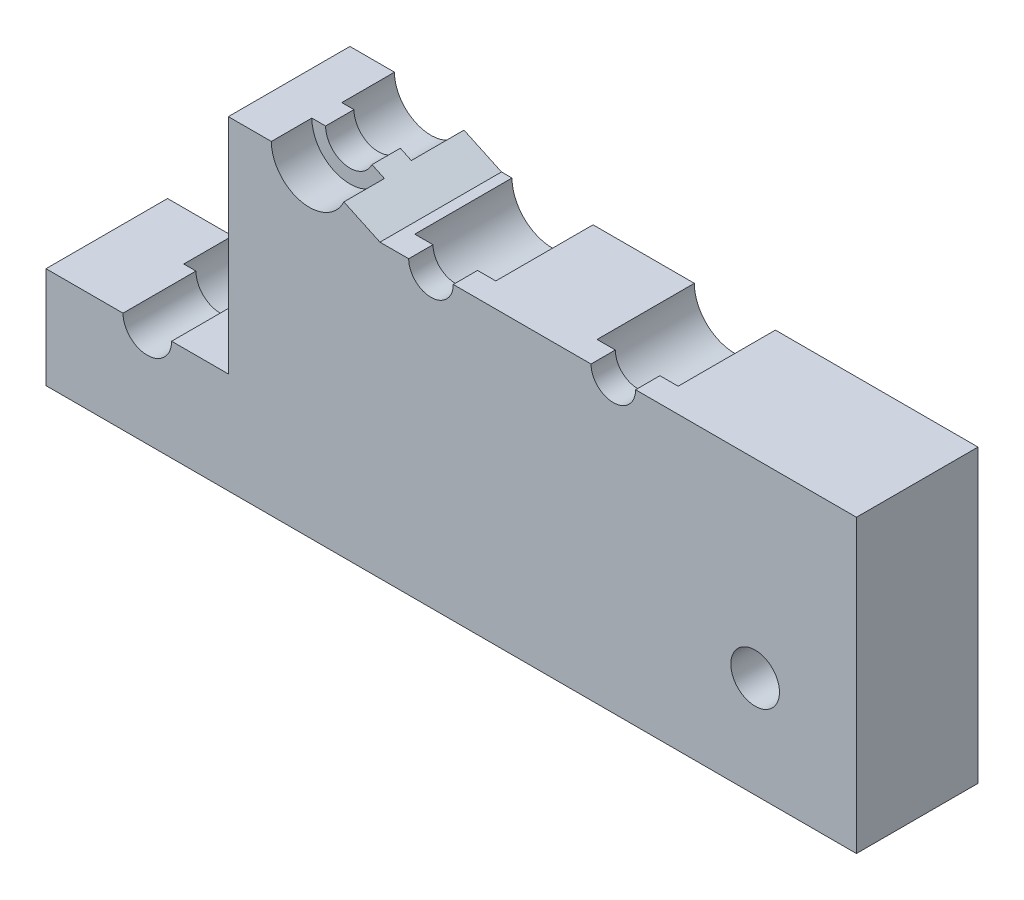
ISO-10303-21;
HEADER;
FILE_DESCRIPTION(('STEP AP214'),'2;1');
FILE_NAME('part.step','',(''),(''),'','','');
FILE_SCHEMA(('AUTOMOTIVE_DESIGN { 1 0 10303 214 1 1 1 1 }'));
ENDSEC;
DATA;
#1=APPLICATION_CONTEXT('core data for automotive mechanical design processes');
#2=APPLICATION_PROTOCOL_DEFINITION('international standard','automotive_design',2000,#1);
#3=PRODUCT_CONTEXT('',#1,'mechanical');
#4=PRODUCT('Part','Part','',(#3));
#5=PRODUCT_RELATED_PRODUCT_CATEGORY('part','',(#4));
#6=PRODUCT_DEFINITION_FORMATION('','',#4);
#7=PRODUCT_DEFINITION_CONTEXT('part definition',#1,'design');
#8=PRODUCT_DEFINITION('design','',#6,#7);
#9=PRODUCT_DEFINITION_SHAPE('','',#8);
#10=(LENGTH_UNIT() NAMED_UNIT(*) SI_UNIT(.MILLI.,.METRE.));
#11=(NAMED_UNIT(*) PLANE_ANGLE_UNIT() SI_UNIT($,.RADIAN.));
#12=(NAMED_UNIT(*) SI_UNIT($,.STERADIAN.) SOLID_ANGLE_UNIT());
#13=UNCERTAINTY_MEASURE_WITH_UNIT(LENGTH_MEASURE(1.E-05),#10,'distance_accuracy_value','');
#14=(GEOMETRIC_REPRESENTATION_CONTEXT(3) GLOBAL_UNCERTAINTY_ASSIGNED_CONTEXT((#13)) GLOBAL_UNIT_ASSIGNED_CONTEXT((#10,
#11,#12)) REPRESENTATION_CONTEXT('',''));
#15=CARTESIAN_POINT('',(0.,0.,0.));
#16=DIRECTION('',(0.,0.,1.));
#17=DIRECTION('',(1.,0.,0.));
#18=AXIS2_PLACEMENT_3D('',#15,#16,#17);
#19=CARTESIAN_POINT('',(0.,0.,30.));
#20=DIRECTION('',(1.,0.,0.));
#21=DIRECTION('',(0.,0.,-1.));
#22=AXIS2_PLACEMENT_3D('',#19,#20,#21);
#23=PLANE('',#22);
#24=DIRECTION('',(0.,-1.,0.));
#25=VECTOR('',#24,1.);
#26=CARTESIAN_POINT('',(0.,0.,30.));
#27=LINE('',#26,#25);
#28=CARTESIAN_POINT('',(0.,25.,30.));
#29=VERTEX_POINT('',#28);
#30=CARTESIAN_POINT('',(0.,0.,30.));
#31=VERTEX_POINT('',#30);
#32=EDGE_CURVE('E396',#29,#31,#27,.T.);
#33=ORIENTED_EDGE('',*,*,#32,.F.);
#34=DIRECTION('',(0.,0.,-1.));
#35=VECTOR('',#34,1.);
#36=CARTESIAN_POINT('',(0.,25.,30.));
#37=LINE('',#36,#35);
#38=CARTESIAN_POINT('',(0.,25.,0.));
#39=VERTEX_POINT('',#38);
#40=EDGE_CURVE('E230',#29,#39,#37,.T.);
#41=ORIENTED_EDGE('',*,*,#40,.T.);
#42=DIRECTION('',(0.,-1.,0.));
#43=VECTOR('',#42,1.);
#44=CARTESIAN_POINT('',(0.,0.,0.));
#45=LINE('',#44,#43);
#46=CARTESIAN_POINT('',(0.,0.,0.));
#47=VERTEX_POINT('',#46);
#48=EDGE_CURVE('E389',#39,#47,#45,.T.);
#49=ORIENTED_EDGE('',*,*,#48,.T.);
#50=DIRECTION('',(0.,0.,-1.));
#51=VECTOR('',#50,1.);
#52=CARTESIAN_POINT('',(0.,0.,30.));
#53=LINE('',#52,#51);
#54=EDGE_CURVE('E406',#31,#47,#53,.T.);
#55=ORIENTED_EDGE('',*,*,#54,.F.);
#56=EDGE_LOOP('',(#33,#41,#49,#55));
#57=FACE_BOUND('',#56,.T.);
#58=ADVANCED_FACE('F28',(#57),#23,.F.);
#59=CARTESIAN_POINT('',(0.,0.,30.));
#60=DIRECTION('',(0.,1.,0.));
#61=DIRECTION('',(0.,0.,1.));
#62=AXIS2_PLACEMENT_3D('',#59,#60,#61);
#63=PLANE('',#62);
#64=DIRECTION('',(1.,0.,0.));
#65=VECTOR('',#64,1.);
#66=CARTESIAN_POINT('',(0.,0.,0.));
#67=LINE('',#66,#65);
#68=CARTESIAN_POINT('',(200.,0.,0.));
#69=VERTEX_POINT('',#68);
#70=EDGE_CURVE('E391',#47,#69,#67,.T.);
#71=ORIENTED_EDGE('',*,*,#70,.T.);
#72=DIRECTION('',(0.,0.,-1.));
#73=VECTOR('',#72,1.);
#74=CARTESIAN_POINT('',(200.,0.,30.));
#75=LINE('',#74,#73);
#76=CARTESIAN_POINT('',(200.,0.,30.));
#77=VERTEX_POINT('',#76);
#78=EDGE_CURVE('E403',#77,#69,#75,.T.);
#79=ORIENTED_EDGE('',*,*,#78,.F.);
#80=DIRECTION('',(1.,0.,0.));
#81=VECTOR('',#80,1.);
#82=CARTESIAN_POINT('',(0.,0.,30.));
#83=LINE('',#82,#81);
#84=EDGE_CURVE('E398',#31,#77,#83,.T.);
#85=ORIENTED_EDGE('',*,*,#84,.F.);
#86=ORIENTED_EDGE('',*,*,#54,.T.);
#87=EDGE_LOOP('',(#71,#79,#85,#86));
#88=FACE_BOUND('',#87,.T.);
#89=ADVANCED_FACE('F479',(#88),#63,.F.);
#90=CARTESIAN_POINT('',(200.,0.,30.));
#91=DIRECTION('',(-1.,0.,0.));
#92=DIRECTION('',(0.,0.,1.));
#93=AXIS2_PLACEMENT_3D('',#90,#91,#92);
#94=PLANE('',#93);
#95=DIRECTION('',(0.,1.,0.));
#96=VECTOR('',#95,1.);
#97=CARTESIAN_POINT('',(200.,0.,0.));
#98=LINE('',#97,#96);
#99=CARTESIAN_POINT('',(200.,71.88,0.));
#100=VERTEX_POINT('',#99);
#101=EDGE_CURVE('E393',#69,#100,#98,.T.);
#102=ORIENTED_EDGE('',*,*,#101,.T.);
#103=DIRECTION('',(0.,0.,1.));
#104=VECTOR('',#103,1.);
#105=CARTESIAN_POINT('',(200.,71.88,30.));
#106=LINE('',#105,#104);
#107=CARTESIAN_POINT('',(200.,71.88,30.));
#108=VERTEX_POINT('',#107);
#109=EDGE_CURVE('E273',#100,#108,#106,.T.);
#110=ORIENTED_EDGE('',*,*,#109,.T.);
#111=DIRECTION('',(0.,1.,0.));
#112=VECTOR('',#111,1.);
#113=CARTESIAN_POINT('',(200.,0.,30.));
#114=LINE('',#113,#112);
#115=EDGE_CURVE('E400',#77,#108,#114,.T.);
#116=ORIENTED_EDGE('',*,*,#115,.F.);
#117=ORIENTED_EDGE('',*,*,#78,.T.);
#118=EDGE_LOOP('',(#102,#110,#116,#117));
#119=FACE_BOUND('',#118,.T.);
#120=ADVANCED_FACE('F458',(#119),#94,.F.);
#121=CARTESIAN_POINT('',(0.,150.,30.));
#122=DIRECTION('',(0.,0.,-1.));
#123=DIRECTION('',(-1.,0.,0.));
#124=AXIS2_PLACEMENT_3D('',#121,#122,#123);
#125=PLANE('',#124);
#126=CARTESIAN_POINT('',(175.,25.,30.));
#127=DIRECTION('',(0.,0.,1.));
#128=DIRECTION('',(1.,0.,0.));
#129=AXIS2_PLACEMENT_3D('',#126,#127,#128);
#130=CIRCLE('',#129,6.00000000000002);
#131=CARTESIAN_POINT('',(181.,25.,30.));
#132=VERTEX_POINT('',#131);
#133=EDGE_CURVE('E347',#132,#132,#130,.T.);
#134=ORIENTED_EDGE('',*,*,#133,.F.);
#135=EDGE_LOOP('',(#134));
#136=FACE_BOUND('',#135,.T.);
#137=CARTESIAN_POINT('',(25.,25.,30.));
#138=DIRECTION('',(0.,0.,1.));
#139=DIRECTION('',(1.,0.,0.));
#140=AXIS2_PLACEMENT_3D('',#137,#138,#139);
#141=CIRCLE('',#140,6.);
#142=CARTESIAN_POINT('',(19.,25.,30.));
#143=VERTEX_POINT('',#142);
#144=CARTESIAN_POINT('',(31.,25.,30.));
#145=VERTEX_POINT('',#144);
#146=EDGE_CURVE('E350',#143,#145,#141,.T.);
#147=ORIENTED_EDGE('',*,*,#146,.F.);
#148=DIRECTION('',(-1.,0.,0.));
#149=VECTOR('',#148,1.);
#150=CARTESIAN_POINT('',(0.,25.,30.));
#151=LINE('',#150,#149);
#152=EDGE_CURVE('E221',#143,#29,#151,.T.);
#153=ORIENTED_EDGE('',*,*,#152,.T.);
#154=ORIENTED_EDGE('',*,*,#32,.T.);
#155=ORIENTED_EDGE('',*,*,#84,.T.);
#156=ORIENTED_EDGE('',*,*,#115,.T.);
#157=DIRECTION('',(-1.,0.,0.));
#158=VECTOR('',#157,1.);
#159=CARTESIAN_POINT('',(0.,71.88,30.));
#160=LINE('',#159,#158);
#161=CARTESIAN_POINT('',(145.5,71.88,30.));
#162=VERTEX_POINT('',#161);
#163=EDGE_CURVE('E263',#108,#162,#160,.T.);
#164=ORIENTED_EDGE('',*,*,#163,.T.);
#165=CARTESIAN_POINT('',(140.,71.88,30.));
#166=DIRECTION('',(0.,0.,1.));
#167=DIRECTION('',(1.,0.,0.));
#168=AXIS2_PLACEMENT_3D('',#165,#166,#167);
#169=CIRCLE('',#168,5.50000000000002);
#170=CARTESIAN_POINT('',(134.5,71.88,30.));
#171=VERTEX_POINT('',#170);
#172=EDGE_CURVE('E369',#171,#162,#169,.T.);
#173=ORIENTED_EDGE('',*,*,#172,.F.);
#174=CARTESIAN_POINT('',(100.5,71.88,30.));
#175=VERTEX_POINT('',#174);
#176=EDGE_CURVE('E264',#171,#175,#160,.T.);
#177=ORIENTED_EDGE('',*,*,#176,.T.);
#178=CARTESIAN_POINT('',(95.,71.88,30.));
#179=DIRECTION('',(0.,0.,1.));
#180=DIRECTION('',(1.,0.,0.));
#181=AXIS2_PLACEMENT_3D('',#178,#179,#180);
#182=CIRCLE('',#181,5.5);
#183=CARTESIAN_POINT('',(89.5,71.88,30.));
#184=VERTEX_POINT('',#183);
#185=EDGE_CURVE('E260',#184,#175,#182,.T.);
#186=ORIENTED_EDGE('',*,*,#185,.F.);
#187=CARTESIAN_POINT('',(82.4133961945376,71.88,30.));
#188=VERTEX_POINT('',#187);
#189=EDGE_CURVE('E245',#184,#188,#160,.T.);
#190=ORIENTED_EDGE('',*,*,#189,.T.);
#191=DIRECTION('',(-0.906307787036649,0.422618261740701,0.));
#192=VECTOR('',#191,1.);
#193=CARTESIAN_POINT('',(-15.2021528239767,117.398878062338,30.));
#194=LINE('',#193,#192);
#195=CARTESIAN_POINT('',(73.5102301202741,76.0316145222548,30.));
#196=VERTEX_POINT('',#195);
#197=EDGE_CURVE('E256',#188,#196,#194,.T.);
#198=ORIENTED_EDGE('',*,*,#197,.T.);
#199=CARTESIAN_POINT('',(65.,80.,30.));
#200=DIRECTION('',(0.,0.,1.));
#201=DIRECTION('',(1.,0.,0.));
#202=AXIS2_PLACEMENT_3D('',#199,#200,#201);
#203=CIRCLE('',#202,9.38999999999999);
#204=CARTESIAN_POINT('',(55.61,80.,30.));
#205=VERTEX_POINT('',#204);
#206=EDGE_CURVE('E384',#205,#196,#203,.T.);
#207=ORIENTED_EDGE('',*,*,#206,.F.);
#208=DIRECTION('',(-1.,0.,0.));
#209=VECTOR('',#208,1.);
#210=CARTESIAN_POINT('',(0.,80.,30.));
#211=LINE('',#210,#209);
#212=CARTESIAN_POINT('',(45.,80.,30.));
#213=VERTEX_POINT('',#212);
#214=EDGE_CURVE('E327',#205,#213,#211,.T.);
#215=ORIENTED_EDGE('',*,*,#214,.T.);
#216=DIRECTION('',(0.,-1.,0.));
#217=VECTOR('',#216,1.);
#218=CARTESIAN_POINT('',(45.,150.,30.));
#219=LINE('',#218,#217);
#220=CARTESIAN_POINT('',(45.,25.,30.));
#221=VERTEX_POINT('',#220);
#222=EDGE_CURVE('E330',#213,#221,#219,.T.);
#223=ORIENTED_EDGE('',*,*,#222,.T.);
#224=EDGE_CURVE('E208',#221,#145,#151,.T.);
#225=ORIENTED_EDGE('',*,*,#224,.T.);
#226=EDGE_LOOP('',(#147,#153,#154,#155,#156,#164,#173,#177,#186,#190,#198,#207,#215,#223,#225));
#227=FACE_BOUND('',#226,.T.);
#228=ADVANCED_FACE('F254',(#136,#227),#125,.F.);
#229=CARTESIAN_POINT('',(0.,150.,0.));
#230=DIRECTION('',(0.,0.,-1.));
#231=DIRECTION('',(-1.,0.,0.));
#232=AXIS2_PLACEMENT_3D('',#229,#230,#231);
#233=PLANE('',#232);
#234=DIRECTION('',(-1.,0.,0.));
#235=VECTOR('',#234,1.);
#236=CARTESIAN_POINT('',(0.,25.,0.));
#237=LINE('',#236,#235);
#238=CARTESIAN_POINT('',(16.,25.,0.));
#239=VERTEX_POINT('',#238);
#240=EDGE_CURVE('E219',#239,#39,#237,.T.);
#241=ORIENTED_EDGE('',*,*,#240,.F.);
#242=CARTESIAN_POINT('',(25.,25.,0.));
#243=DIRECTION('',(0.,0.,1.));
#244=DIRECTION('',(1.,0.,0.));
#245=AXIS2_PLACEMENT_3D('',#242,#243,#244);
#246=CIRCLE('',#245,9.);
#247=CARTESIAN_POINT('',(34.,25.,0.));
#248=VERTEX_POINT('',#247);
#249=EDGE_CURVE('E216',#239,#248,#246,.T.);
#250=ORIENTED_EDGE('',*,*,#249,.T.);
#251=CARTESIAN_POINT('',(45.,25.,0.));
#252=VERTEX_POINT('',#251);
#253=EDGE_CURVE('E205',#252,#248,#237,.T.);
#254=ORIENTED_EDGE('',*,*,#253,.F.);
#255=DIRECTION('',(0.,-1.,0.));
#256=VECTOR('',#255,1.);
#257=CARTESIAN_POINT('',(45.,150.,0.));
#258=LINE('',#257,#256);
#259=CARTESIAN_POINT('',(45.,80.,0.));
#260=VERTEX_POINT('',#259);
#261=EDGE_CURVE('E11',#260,#252,#258,.T.);
#262=ORIENTED_EDGE('',*,*,#261,.F.);
#263=DIRECTION('',(-1.,0.,0.));
#264=VECTOR('',#263,1.);
#265=CARTESIAN_POINT('',(0.,80.,0.));
#266=LINE('',#265,#264);
#267=CARTESIAN_POINT('',(56.,80.,0.));
#268=VERTEX_POINT('',#267);
#269=EDGE_CURVE('E325',#268,#260,#266,.T.);
#270=ORIENTED_EDGE('',*,*,#269,.F.);
#271=CARTESIAN_POINT('',(65.,80.,0.));
#272=DIRECTION('',(0.,0.,1.));
#273=DIRECTION('',(1.,0.,0.));
#274=AXIS2_PLACEMENT_3D('',#271,#272,#273);
#275=CIRCLE('',#274,9.00000000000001);
#276=CARTESIAN_POINT('',(73.1567700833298,76.1964356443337,0.));
#277=VERTEX_POINT('',#276);
#278=EDGE_CURVE('E375',#268,#277,#275,.T.);
#279=ORIENTED_EDGE('',*,*,#278,.T.);
#280=DIRECTION('',(-0.906307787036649,0.422618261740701,0.));
#281=VECTOR('',#280,1.);
#282=CARTESIAN_POINT('',(-15.2021528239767,117.398878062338,0.));
#283=LINE('',#282,#281);
#284=CARTESIAN_POINT('',(82.4133961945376,71.88,0.));
#285=VERTEX_POINT('',#284);
#286=EDGE_CURVE('E311',#285,#277,#283,.T.);
#287=ORIENTED_EDGE('',*,*,#286,.F.);
#288=DIRECTION('',(-1.,0.,0.));
#289=VECTOR('',#288,1.);
#290=CARTESIAN_POINT('',(0.,71.88,0.));
#291=LINE('',#290,#289);
#292=CARTESIAN_POINT('',(85.,71.88,0.));
#293=VERTEX_POINT('',#292);
#294=EDGE_CURVE('E248',#293,#285,#291,.T.);
#295=ORIENTED_EDGE('',*,*,#294,.F.);
#296=CARTESIAN_POINT('',(95.,71.88,0.));
#297=DIRECTION('',(0.,0.,1.));
#298=DIRECTION('',(1.,0.,0.));
#299=AXIS2_PLACEMENT_3D('',#296,#297,#298);
#300=CIRCLE('',#299,9.99999999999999);
#301=CARTESIAN_POINT('',(105.,71.88,0.));
#302=VERTEX_POINT('',#301);
#303=EDGE_CURVE('E355',#293,#302,#300,.T.);
#304=ORIENTED_EDGE('',*,*,#303,.T.);
#305=CARTESIAN_POINT('',(130.,71.88,0.));
#306=VERTEX_POINT('',#305);
#307=EDGE_CURVE('E270',#306,#302,#291,.T.);
#308=ORIENTED_EDGE('',*,*,#307,.F.);
#309=CARTESIAN_POINT('',(140.,71.88,0.));
#310=DIRECTION('',(0.,0.,1.));
#311=DIRECTION('',(1.,0.,0.));
#312=AXIS2_PLACEMENT_3D('',#309,#310,#311);
#313=CIRCLE('',#312,10.);
#314=CARTESIAN_POINT('',(150.,71.88,0.));
#315=VERTEX_POINT('',#314);
#316=EDGE_CURVE('E364',#306,#315,#313,.T.);
#317=ORIENTED_EDGE('',*,*,#316,.T.);
#318=EDGE_CURVE('E42',#100,#315,#291,.T.);
#319=ORIENTED_EDGE('',*,*,#318,.F.);
#320=ORIENTED_EDGE('',*,*,#101,.F.);
#321=ORIENTED_EDGE('',*,*,#70,.F.);
#322=ORIENTED_EDGE('',*,*,#48,.F.);
#323=EDGE_LOOP('',(#241,#250,#254,#262,#270,#279,#287,#295,#304,#308,#317,#319,#320,#321,#322));
#324=FACE_BOUND('',#323,.T.);
#325=CARTESIAN_POINT('',(175.,25.,0.));
#326=DIRECTION('',(0.,0.,1.));
#327=DIRECTION('',(1.,0.,0.));
#328=AXIS2_PLACEMENT_3D('',#325,#326,#327);
#329=CIRCLE('',#328,9.00000000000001);
#330=CARTESIAN_POINT('',(184.,25.,0.));
#331=VERTEX_POINT('',#330);
#332=EDGE_CURVE('E341',#331,#331,#329,.T.);
#333=ORIENTED_EDGE('',*,*,#332,.T.);
#334=EDGE_LOOP('',(#333));
#335=FACE_BOUND('',#334,.T.);
#336=ADVANCED_FACE('F213',(#324,#335),#233,.T.);
#337=CARTESIAN_POINT('',(65.,80.,20.));
#338=DIRECTION('',(0.,0.,1.));
#339=DIRECTION('',(1.,0.,0.));
#340=AXIS2_PLACEMENT_3D('',#337,#338,#339);
#341=CYLINDRICAL_SURFACE('',#340,9.38999999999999);
#342=CARTESIAN_POINT('',(65.,80.,20.));
#343=DIRECTION('',(0.,0.,1.));
#344=DIRECTION('',(1.,0.,0.));
#345=AXIS2_PLACEMENT_3D('',#342,#343,#344);
#346=CIRCLE('',#345,9.38999999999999);
#347=CARTESIAN_POINT('',(55.61,80.,20.));
#348=VERTEX_POINT('',#347);
#349=CARTESIAN_POINT('',(73.5102301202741,76.0316145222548,20.));
#350=VERTEX_POINT('',#349);
#351=EDGE_CURVE('E386',#348,#350,#346,.T.);
#352=ORIENTED_EDGE('',*,*,#351,.F.);
#353=DIRECTION('',(0.,0.,1.));
#354=VECTOR('',#353,1.);
#355=CARTESIAN_POINT('',(55.61,80.,20.));
#356=LINE('',#355,#354);
#357=EDGE_CURVE('E322',#348,#205,#356,.T.);
#358=ORIENTED_EDGE('',*,*,#357,.T.);
#359=ORIENTED_EDGE('',*,*,#206,.T.);
#360=DIRECTION('',(0.,0.,1.));
#361=VECTOR('',#360,1.);
#362=CARTESIAN_POINT('',(73.5102301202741,76.0316145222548,20.));
#363=LINE('',#362,#361);
#364=EDGE_CURVE('E308',#196,#350,#363,.F.);
#365=ORIENTED_EDGE('',*,*,#364,.T.);
#366=EDGE_LOOP('',(#352,#358,#359,#365));
#367=FACE_BOUND('',#366,.T.);
#368=ADVANCED_FACE('F439',(#367),#341,.F.);
#369=CARTESIAN_POINT('',(65.,80.,20.));
#370=DIRECTION('',(0.,0.,1.));
#371=DIRECTION('',(1.,0.,0.));
#372=AXIS2_PLACEMENT_3D('',#369,#370,#371);
#373=PLANE('',#372);
#374=DIRECTION('',(1.,0.,0.));
#375=VECTOR('',#374,1.);
#376=CARTESIAN_POINT('',(65.,80.,20.));
#377=LINE('',#376,#375);
#378=CARTESIAN_POINT('',(59.,80.,20.));
#379=VERTEX_POINT('',#378);
#380=EDGE_CURVE('E320',#348,#379,#377,.T.);
#381=ORIENTED_EDGE('',*,*,#380,.F.);
#382=ORIENTED_EDGE('',*,*,#351,.T.);
#383=DIRECTION('',(0.906307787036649,-0.422618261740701,0.));
#384=VECTOR('',#383,1.);
#385=CARTESIAN_POINT('',(65.,80.,20.));
#386=LINE('',#385,#384);
#387=CARTESIAN_POINT('',(70.4378467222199,77.4642904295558,20.));
#388=VERTEX_POINT('',#387);
#389=EDGE_CURVE('E306',#388,#350,#386,.T.);
#390=ORIENTED_EDGE('',*,*,#389,.F.);
#391=CARTESIAN_POINT('',(65.,80.,20.));
#392=DIRECTION('',(0.,0.,1.));
#393=DIRECTION('',(1.,0.,0.));
#394=AXIS2_PLACEMENT_3D('',#391,#392,#393);
#395=CIRCLE('',#394,6.);
#396=EDGE_CURVE('E381',#379,#388,#395,.T.);
#397=ORIENTED_EDGE('',*,*,#396,.F.);
#398=EDGE_LOOP('',(#381,#382,#390,#397));
#399=FACE_BOUND('',#398,.T.);
#400=ADVANCED_FACE('F436',(#399),#373,.T.);
#401=CARTESIAN_POINT('',(65.,80.,13.));
#402=DIRECTION('',(0.,0.,1.));
#403=DIRECTION('',(1.,0.,0.));
#404=AXIS2_PLACEMENT_3D('',#401,#402,#403);
#405=CYLINDRICAL_SURFACE('',#404,6.);
#406=CARTESIAN_POINT('',(65.,80.,13.));
#407=DIRECTION('',(0.,0.,1.));
#408=DIRECTION('',(1.,0.,0.));
#409=AXIS2_PLACEMENT_3D('',#406,#407,#408);
#410=CIRCLE('',#409,6.);
#411=CARTESIAN_POINT('',(70.4378467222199,77.4642904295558,13.));
#412=VERTEX_POINT('',#411);
#413=CARTESIAN_POINT('',(59.,80.,13.));
#414=VERTEX_POINT('',#413);
#415=EDGE_CURVE('E378',#412,#414,#410,.F.);
#416=ORIENTED_EDGE('',*,*,#415,.T.);
#417=DIRECTION('',(0.,0.,1.));
#418=VECTOR('',#417,1.);
#419=CARTESIAN_POINT('',(59.,80.,13.));
#420=LINE('',#419,#418);
#421=EDGE_CURVE('E317',#414,#379,#420,.T.);
#422=ORIENTED_EDGE('',*,*,#421,.T.);
#423=ORIENTED_EDGE('',*,*,#396,.T.);
#424=DIRECTION('',(0.,0.,1.));
#425=VECTOR('',#424,1.);
#426=CARTESIAN_POINT('',(70.4378467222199,77.4642904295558,13.));
#427=LINE('',#426,#425);
#428=EDGE_CURVE('E303',#388,#412,#427,.F.);
#429=ORIENTED_EDGE('',*,*,#428,.T.);
#430=EDGE_LOOP('',(#416,#422,#423,#429));
#431=FACE_BOUND('',#430,.T.);
#432=ADVANCED_FACE('F432',(#431),#405,.F.);
#433=CARTESIAN_POINT('',(65.,80.,13.));
#434=DIRECTION('',(0.,0.,1.));
#435=DIRECTION('',(1.,0.,0.));
#436=AXIS2_PLACEMENT_3D('',#433,#434,#435);
#437=PLANE('',#436);
#438=CARTESIAN_POINT('',(65.,80.,13.));
#439=DIRECTION('',(0.,0.,1.));
#440=DIRECTION('',(1.,0.,0.));
#441=AXIS2_PLACEMENT_3D('',#438,#439,#440);
#442=CIRCLE('',#441,9.00000000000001);
#443=CARTESIAN_POINT('',(56.,80.,13.));
#444=VERTEX_POINT('',#443);
#445=CARTESIAN_POINT('',(73.1567700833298,76.1964356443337,13.));
#446=VERTEX_POINT('',#445);
#447=EDGE_CURVE('E372',#444,#446,#442,.T.);
#448=ORIENTED_EDGE('',*,*,#447,.F.);
#449=DIRECTION('',(1.,0.,0.));
#450=VECTOR('',#449,1.);
#451=CARTESIAN_POINT('',(65.,80.,13.));
#452=LINE('',#451,#450);
#453=EDGE_CURVE('E314',#444,#414,#452,.T.);
#454=ORIENTED_EDGE('',*,*,#453,.T.);
#455=ORIENTED_EDGE('',*,*,#415,.F.);
#456=DIRECTION('',(0.906307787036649,-0.422618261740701,0.));
#457=VECTOR('',#456,1.);
#458=CARTESIAN_POINT('',(65.,80.,13.));
#459=LINE('',#458,#457);
#460=EDGE_CURVE('E300',#412,#446,#459,.T.);
#461=ORIENTED_EDGE('',*,*,#460,.T.);
#462=EDGE_LOOP('',(#448,#454,#455,#461));
#463=FACE_BOUND('',#462,.T.);
#464=ADVANCED_FACE('F427',(#463),#437,.F.);
#465=CARTESIAN_POINT('',(65.,80.,0.));
#466=DIRECTION('',(0.,0.,1.));
#467=DIRECTION('',(1.,0.,0.));
#468=AXIS2_PLACEMENT_3D('',#465,#466,#467);
#469=CYLINDRICAL_SURFACE('',#468,9.00000000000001);
#470=ORIENTED_EDGE('',*,*,#278,.F.);
#471=DIRECTION('',(0.,0.,1.));
#472=VECTOR('',#471,1.);
#473=CARTESIAN_POINT('',(56.,80.,0.));
#474=LINE('',#473,#472);
#475=EDGE_CURVE('E35',#268,#444,#474,.T.);
#476=ORIENTED_EDGE('',*,*,#475,.T.);
#477=ORIENTED_EDGE('',*,*,#447,.T.);
#478=DIRECTION('',(0.,0.,1.));
#479=VECTOR('',#478,1.);
#480=CARTESIAN_POINT('',(73.1567700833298,76.1964356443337,0.));
#481=LINE('',#480,#479);
#482=EDGE_CURVE('E418',#446,#277,#481,.F.);
#483=ORIENTED_EDGE('',*,*,#482,.T.);
#484=EDGE_LOOP('',(#470,#476,#477,#483));
#485=FACE_BOUND('',#484,.T.);
#486=ADVANCED_FACE('F424',(#485),#469,.F.);
#487=CARTESIAN_POINT('',(95.,71.88,24.));
#488=DIRECTION('',(0.,0.,1.));
#489=DIRECTION('',(1.,0.,0.));
#490=AXIS2_PLACEMENT_3D('',#487,#488,#489);
#491=CYLINDRICAL_SURFACE('',#490,5.5);
#492=ORIENTED_EDGE('',*,*,#185,.T.);
#493=DIRECTION('',(0.,0.,1.));
#494=VECTOR('',#493,1.);
#495=CARTESIAN_POINT('',(100.5,71.88,24.));
#496=LINE('',#495,#494);
#497=CARTESIAN_POINT('',(100.5,71.88,24.));
#498=VERTEX_POINT('',#497);
#499=EDGE_CURVE('E266',#175,#498,#496,.F.);
#500=ORIENTED_EDGE('',*,*,#499,.T.);
#501=CARTESIAN_POINT('',(95.,71.88,24.));
#502=DIRECTION('',(0.,0.,1.));
#503=DIRECTION('',(1.,0.,0.));
#504=AXIS2_PLACEMENT_3D('',#501,#502,#503);
#505=CIRCLE('',#504,5.5);
#506=CARTESIAN_POINT('',(89.5,71.88,24.));
#507=VERTEX_POINT('',#506);
#508=EDGE_CURVE('E358',#498,#507,#505,.F.);
#509=ORIENTED_EDGE('',*,*,#508,.T.);
#510=DIRECTION('',(0.,0.,1.));
#511=VECTOR('',#510,1.);
#512=CARTESIAN_POINT('',(89.5,71.88,24.));
#513=LINE('',#512,#511);
#514=EDGE_CURVE('E268',#507,#184,#513,.T.);
#515=ORIENTED_EDGE('',*,*,#514,.T.);
#516=EDGE_LOOP('',(#492,#500,#509,#515));
#517=FACE_BOUND('',#516,.T.);
#518=ADVANCED_FACE('F450',(#517),#491,.F.);
#519=CARTESIAN_POINT('',(140.,71.88,24.));
#520=DIRECTION('',(0.,0.,1.));
#521=DIRECTION('',(1.,0.,0.));
#522=AXIS2_PLACEMENT_3D('',#519,#520,#521);
#523=CYLINDRICAL_SURFACE('',#522,5.50000000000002);
#524=ORIENTED_EDGE('',*,*,#172,.T.);
#525=DIRECTION('',(0.,0.,1.));
#526=VECTOR('',#525,1.);
#527=CARTESIAN_POINT('',(145.5,71.88,24.));
#528=LINE('',#527,#526);
#529=CARTESIAN_POINT('',(145.5,71.88,24.));
#530=VERTEX_POINT('',#529);
#531=EDGE_CURVE('E284',#162,#530,#528,.F.);
#532=ORIENTED_EDGE('',*,*,#531,.T.);
#533=CARTESIAN_POINT('',(140.,71.88,24.));
#534=DIRECTION('',(0.,0.,1.));
#535=DIRECTION('',(1.,0.,0.));
#536=AXIS2_PLACEMENT_3D('',#533,#534,#535);
#537=CIRCLE('',#536,5.50000000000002);
#538=CARTESIAN_POINT('',(134.5,71.88,24.));
#539=VERTEX_POINT('',#538);
#540=EDGE_CURVE('E367',#530,#539,#537,.F.);
#541=ORIENTED_EDGE('',*,*,#540,.T.);
#542=DIRECTION('',(0.,0.,1.));
#543=VECTOR('',#542,1.);
#544=CARTESIAN_POINT('',(134.5,71.88,24.));
#545=LINE('',#544,#543);
#546=EDGE_CURVE('E452',#539,#171,#545,.T.);
#547=ORIENTED_EDGE('',*,*,#546,.T.);
#548=EDGE_LOOP('',(#524,#532,#541,#547));
#549=FACE_BOUND('',#548,.T.);
#550=ADVANCED_FACE('F454',(#549),#523,.F.);
#551=CARTESIAN_POINT('',(140.,71.88,24.));
#552=DIRECTION('',(0.,0.,1.));
#553=DIRECTION('',(1.,0.,0.));
#554=AXIS2_PLACEMENT_3D('',#551,#552,#553);
#555=PLANE('',#554);
#556=CARTESIAN_POINT('',(140.,71.88,24.));
#557=DIRECTION('',(0.,0.,1.));
#558=DIRECTION('',(1.,0.,0.));
#559=AXIS2_PLACEMENT_3D('',#556,#557,#558);
#560=CIRCLE('',#559,10.);
#561=CARTESIAN_POINT('',(130.,71.88,24.));
#562=VERTEX_POINT('',#561);
#563=CARTESIAN_POINT('',(150.,71.88,24.));
#564=VERTEX_POINT('',#563);
#565=EDGE_CURVE('E361',#562,#564,#560,.T.);
#566=ORIENTED_EDGE('',*,*,#565,.F.);
#567=DIRECTION('',(1.,0.,0.));
#568=VECTOR('',#567,1.);
#569=CARTESIAN_POINT('',(140.,71.88,24.));
#570=LINE('',#569,#568);
#571=EDGE_CURVE('E277',#562,#539,#570,.T.);
#572=ORIENTED_EDGE('',*,*,#571,.T.);
#573=ORIENTED_EDGE('',*,*,#540,.F.);
#574=EDGE_CURVE('E286',#530,#564,#570,.T.);
#575=ORIENTED_EDGE('',*,*,#574,.T.);
#576=EDGE_LOOP('',(#566,#572,#573,#575));
#577=FACE_BOUND('',#576,.T.);
#578=ADVANCED_FACE('F468',(#577),#555,.F.);
#579=CARTESIAN_POINT('',(140.,71.88,0.));
#580=DIRECTION('',(0.,0.,1.));
#581=DIRECTION('',(1.,0.,0.));
#582=AXIS2_PLACEMENT_3D('',#579,#580,#581);
#583=CYLINDRICAL_SURFACE('',#582,10.);
#584=ORIENTED_EDGE('',*,*,#565,.T.);
#585=DIRECTION('',(0.,0.,1.));
#586=VECTOR('',#585,1.);
#587=CARTESIAN_POINT('',(150.,71.88,0.));
#588=LINE('',#587,#586);
#589=EDGE_CURVE('E293',#564,#315,#588,.F.);
#590=ORIENTED_EDGE('',*,*,#589,.T.);
#591=ORIENTED_EDGE('',*,*,#316,.F.);
#592=DIRECTION('',(0.,0.,1.));
#593=VECTOR('',#592,1.);
#594=CARTESIAN_POINT('',(130.,71.88,0.));
#595=LINE('',#594,#593);
#596=EDGE_CURVE('E274',#306,#562,#595,.T.);
#597=ORIENTED_EDGE('',*,*,#596,.T.);
#598=EDGE_LOOP('',(#584,#590,#591,#597));
#599=FACE_BOUND('',#598,.T.);
#600=ADVANCED_FACE('F465',(#599),#583,.F.);
#601=CARTESIAN_POINT('',(95.,71.88,24.));
#602=DIRECTION('',(0.,0.,1.));
#603=DIRECTION('',(1.,0.,0.));
#604=AXIS2_PLACEMENT_3D('',#601,#602,#603);
#605=PLANE('',#604);
#606=CARTESIAN_POINT('',(95.,71.88,24.));
#607=DIRECTION('',(0.,0.,1.));
#608=DIRECTION('',(1.,0.,0.));
#609=AXIS2_PLACEMENT_3D('',#606,#607,#608);
#610=CIRCLE('',#609,9.99999999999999);
#611=CARTESIAN_POINT('',(85.,71.88,24.));
#612=VERTEX_POINT('',#611);
#613=CARTESIAN_POINT('',(105.,71.88,24.));
#614=VERTEX_POINT('',#613);
#615=EDGE_CURVE('E352',#612,#614,#610,.T.);
#616=ORIENTED_EDGE('',*,*,#615,.F.);
#617=DIRECTION('',(1.,0.,0.));
#618=VECTOR('',#617,1.);
#619=CARTESIAN_POINT('',(95.,71.88,24.));
#620=LINE('',#619,#618);
#621=EDGE_CURVE('E50',#612,#507,#620,.T.);
#622=ORIENTED_EDGE('',*,*,#621,.T.);
#623=ORIENTED_EDGE('',*,*,#508,.F.);
#624=EDGE_CURVE('E261',#498,#614,#620,.T.);
#625=ORIENTED_EDGE('',*,*,#624,.T.);
#626=EDGE_LOOP('',(#616,#622,#623,#625));
#627=FACE_BOUND('',#626,.T.);
#628=ADVANCED_FACE('F448',(#627),#605,.F.);
#629=CARTESIAN_POINT('',(95.,71.88,0.));
#630=DIRECTION('',(0.,0.,1.));
#631=DIRECTION('',(1.,0.,0.));
#632=AXIS2_PLACEMENT_3D('',#629,#630,#631);
#633=CYLINDRICAL_SURFACE('',#632,9.99999999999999);
#634=ORIENTED_EDGE('',*,*,#615,.T.);
#635=DIRECTION('',(0.,0.,1.));
#636=VECTOR('',#635,1.);
#637=CARTESIAN_POINT('',(105.,71.88,0.));
#638=LINE('',#637,#636);
#639=EDGE_CURVE('E416',#614,#302,#638,.F.);
#640=ORIENTED_EDGE('',*,*,#639,.T.);
#641=ORIENTED_EDGE('',*,*,#303,.F.);
#642=DIRECTION('',(0.,0.,1.));
#643=VECTOR('',#642,1.);
#644=CARTESIAN_POINT('',(85.,71.88,0.));
#645=LINE('',#644,#643);
#646=EDGE_CURVE('E414',#293,#612,#645,.T.);
#647=ORIENTED_EDGE('',*,*,#646,.T.);
#648=EDGE_LOOP('',(#634,#640,#641,#647));
#649=FACE_BOUND('',#648,.T.);
#650=ADVANCED_FACE('F443',(#649),#633,.F.);
#651=CARTESIAN_POINT('',(25.,25.,12.));
#652=DIRECTION('',(0.,0.,1.));
#653=DIRECTION('',(1.,0.,0.));
#654=AXIS2_PLACEMENT_3D('',#651,#652,#653);
#655=CYLINDRICAL_SURFACE('',#654,6.);
#656=ORIENTED_EDGE('',*,*,#146,.T.);
#657=DIRECTION('',(0.,0.,1.));
#658=VECTOR('',#657,1.);
#659=CARTESIAN_POINT('',(31.,25.,12.));
#660=LINE('',#659,#658);
#661=CARTESIAN_POINT('',(31.,25.,12.));
#662=VERTEX_POINT('',#661);
#663=EDGE_CURVE('E217',#145,#662,#660,.F.);
#664=ORIENTED_EDGE('',*,*,#663,.T.);
#665=CARTESIAN_POINT('',(25.,25.,12.));
#666=DIRECTION('',(0.,0.,1.));
#667=DIRECTION('',(1.,0.,0.));
#668=AXIS2_PLACEMENT_3D('',#665,#666,#667);
#669=CIRCLE('',#668,6.);
#670=CARTESIAN_POINT('',(19.,25.,12.));
#671=VERTEX_POINT('',#670);
#672=EDGE_CURVE('E336',#662,#671,#669,.F.);
#673=ORIENTED_EDGE('',*,*,#672,.T.);
#674=DIRECTION('',(0.,0.,1.));
#675=VECTOR('',#674,1.);
#676=CARTESIAN_POINT('',(19.,25.,12.));
#677=LINE('',#676,#675);
#678=EDGE_CURVE('E226',#671,#143,#677,.T.);
#679=ORIENTED_EDGE('',*,*,#678,.T.);
#680=EDGE_LOOP('',(#656,#664,#673,#679));
#681=FACE_BOUND('',#680,.T.);
#682=ADVANCED_FACE('F497',(#681),#655,.F.);
#683=CARTESIAN_POINT('',(175.,25.,12.));
#684=DIRECTION('',(0.,0.,1.));
#685=DIRECTION('',(1.,0.,0.));
#686=AXIS2_PLACEMENT_3D('',#683,#684,#685);
#687=CYLINDRICAL_SURFACE('',#686,6.00000000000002);
#688=CARTESIAN_POINT('',(175.,25.,12.));
#689=DIRECTION('',(0.,0.,1.));
#690=DIRECTION('',(1.,0.,0.));
#691=AXIS2_PLACEMENT_3D('',#688,#689,#690);
#692=CIRCLE('',#691,6.00000000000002);
#693=CARTESIAN_POINT('',(181.,25.,12.));
#694=VERTEX_POINT('',#693);
#695=EDGE_CURVE('E344',#694,#694,#692,.F.);
#696=ORIENTED_EDGE('',*,*,#695,.T.);
#697=EDGE_LOOP('',(#696));
#698=FACE_BOUND('',#697,.T.);
#699=ORIENTED_EDGE('',*,*,#133,.T.);
#700=EDGE_LOOP('',(#699));
#701=FACE_BOUND('',#700,.T.);
#702=ADVANCED_FACE('F499',(#698,#701),#687,.F.);
#703=CARTESIAN_POINT('',(175.,25.,12.));
#704=DIRECTION('',(0.,0.,1.));
#705=DIRECTION('',(1.,0.,0.));
#706=AXIS2_PLACEMENT_3D('',#703,#704,#705);
#707=PLANE('',#706);
#708=CARTESIAN_POINT('',(175.,25.,12.));
#709=DIRECTION('',(0.,0.,1.));
#710=DIRECTION('',(1.,0.,0.));
#711=AXIS2_PLACEMENT_3D('',#708,#709,#710);
#712=CIRCLE('',#711,9.00000000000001);
#713=CARTESIAN_POINT('',(184.,25.,12.));
#714=VERTEX_POINT('',#713);
#715=EDGE_CURVE('E338',#714,#714,#712,.T.);
#716=ORIENTED_EDGE('',*,*,#715,.F.);
#717=EDGE_LOOP('',(#716));
#718=FACE_BOUND('',#717,.T.);
#719=ORIENTED_EDGE('',*,*,#695,.F.);
#720=EDGE_LOOP('',(#719));
#721=FACE_BOUND('',#720,.T.);
#722=ADVANCED_FACE('F505',(#718,#721),#707,.F.);
#723=CARTESIAN_POINT('',(175.,25.,0.));
#724=DIRECTION('',(0.,0.,1.));
#725=DIRECTION('',(1.,0.,0.));
#726=AXIS2_PLACEMENT_3D('',#723,#724,#725);
#727=CYLINDRICAL_SURFACE('',#726,9.00000000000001);
#728=ORIENTED_EDGE('',*,*,#332,.F.);
#729=EDGE_LOOP('',(#728));
#730=FACE_BOUND('',#729,.T.);
#731=ORIENTED_EDGE('',*,*,#715,.T.);
#732=EDGE_LOOP('',(#731));
#733=FACE_BOUND('',#732,.T.);
#734=ADVANCED_FACE('F538',(#730,#733),#727,.F.);
#735=CARTESIAN_POINT('',(25.,25.,12.));
#736=DIRECTION('',(0.,0.,1.));
#737=DIRECTION('',(1.,0.,0.));
#738=AXIS2_PLACEMENT_3D('',#735,#736,#737);
#739=PLANE('',#738);
#740=CARTESIAN_POINT('',(25.,25.,12.));
#741=DIRECTION('',(0.,0.,1.));
#742=DIRECTION('',(1.,0.,0.));
#743=AXIS2_PLACEMENT_3D('',#740,#741,#742);
#744=CIRCLE('',#743,9.);
#745=CARTESIAN_POINT('',(16.,25.,12.));
#746=VERTEX_POINT('',#745);
#747=CARTESIAN_POINT('',(34.,25.,12.));
#748=VERTEX_POINT('',#747);
#749=EDGE_CURVE('E332',#746,#748,#744,.T.);
#750=ORIENTED_EDGE('',*,*,#749,.F.);
#751=DIRECTION('',(1.,0.,0.));
#752=VECTOR('',#751,1.);
#753=CARTESIAN_POINT('',(25.,25.,12.));
#754=LINE('',#753,#752);
#755=EDGE_CURVE('E209',#746,#671,#754,.T.);
#756=ORIENTED_EDGE('',*,*,#755,.T.);
#757=ORIENTED_EDGE('',*,*,#672,.F.);
#758=EDGE_CURVE('E223',#662,#748,#754,.T.);
#759=ORIENTED_EDGE('',*,*,#758,.T.);
#760=EDGE_LOOP('',(#750,#756,#757,#759));
#761=FACE_BOUND('',#760,.T.);
#762=ADVANCED_FACE('F494',(#761),#739,.F.);
#763=CARTESIAN_POINT('',(25.,25.,0.));
#764=DIRECTION('',(0.,0.,1.));
#765=DIRECTION('',(1.,0.,0.));
#766=AXIS2_PLACEMENT_3D('',#763,#764,#765);
#767=CYLINDRICAL_SURFACE('',#766,9.);
#768=ORIENTED_EDGE('',*,*,#749,.T.);
#769=DIRECTION('',(0.,0.,1.));
#770=VECTOR('',#769,1.);
#771=CARTESIAN_POINT('',(34.,25.,0.));
#772=LINE('',#771,#770);
#773=EDGE_CURVE('E412',#748,#248,#772,.F.);
#774=ORIENTED_EDGE('',*,*,#773,.T.);
#775=ORIENTED_EDGE('',*,*,#249,.F.);
#776=DIRECTION('',(0.,0.,1.));
#777=VECTOR('',#776,1.);
#778=CARTESIAN_POINT('',(16.,25.,0.));
#779=LINE('',#778,#777);
#780=EDGE_CURVE('E409',#239,#746,#779,.T.);
#781=ORIENTED_EDGE('',*,*,#780,.T.);
#782=EDGE_LOOP('',(#768,#774,#775,#781));
#783=FACE_BOUND('',#782,.T.);
#784=ADVANCED_FACE('F496',(#783),#767,.F.);
#785=CARTESIAN_POINT('',(-5.38641686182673,25.,-314.741957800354));
#786=DIRECTION('',(0.,-1.,0.));
#787=DIRECTION('',(1.,0.,0.));
#788=AXIS2_PLACEMENT_3D('',#785,#786,#787);
#789=PLANE('',#788);
#790=ORIENTED_EDGE('',*,*,#40,.F.);
#791=ORIENTED_EDGE('',*,*,#152,.F.);
#792=ORIENTED_EDGE('',*,*,#678,.F.);
#793=ORIENTED_EDGE('',*,*,#755,.F.);
#794=ORIENTED_EDGE('',*,*,#780,.F.);
#795=ORIENTED_EDGE('',*,*,#240,.T.);
#796=EDGE_LOOP('',(#790,#791,#792,#793,#794,#795));
#797=FACE_BOUND('',#796,.T.);
#798=ADVANCED_FACE('F488',(#797),#789,.F.);
#799=ORIENTED_EDGE('',*,*,#224,.F.);
#800=DIRECTION('',(0.,0.,1.));
#801=VECTOR('',#800,1.);
#802=CARTESIAN_POINT('',(45.,25.,-314.741957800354));
#803=LINE('',#802,#801);
#804=EDGE_CURVE('E196',#252,#221,#803,.T.);
#805=ORIENTED_EDGE('',*,*,#804,.F.);
#806=ORIENTED_EDGE('',*,*,#253,.T.);
#807=ORIENTED_EDGE('',*,*,#773,.F.);
#808=ORIENTED_EDGE('',*,*,#758,.F.);
#809=ORIENTED_EDGE('',*,*,#663,.F.);
#810=EDGE_LOOP('',(#799,#805,#806,#807,#808,#809));
#811=FACE_BOUND('',#810,.T.);
#812=ADVANCED_FACE('F204',(#811),#789,.F.);
#813=CARTESIAN_POINT('',(45.,80.,-314.741957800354));
#814=DIRECTION('',(0.,-1.,0.));
#815=DIRECTION('',(1.,0.,0.));
#816=AXIS2_PLACEMENT_3D('',#813,#814,#815);
#817=PLANE('',#816);
#818=ORIENTED_EDGE('',*,*,#214,.F.);
#819=ORIENTED_EDGE('',*,*,#357,.F.);
#820=ORIENTED_EDGE('',*,*,#380,.T.);
#821=ORIENTED_EDGE('',*,*,#421,.F.);
#822=ORIENTED_EDGE('',*,*,#453,.F.);
#823=ORIENTED_EDGE('',*,*,#475,.F.);
#824=ORIENTED_EDGE('',*,*,#269,.T.);
#825=DIRECTION('',(0.,0.,1.));
#826=VECTOR('',#825,1.);
#827=CARTESIAN_POINT('',(45.,80.,-314.741957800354));
#828=LINE('',#827,#826);
#829=EDGE_CURVE('E199',#260,#213,#828,.T.);
#830=ORIENTED_EDGE('',*,*,#829,.T.);
#831=EDGE_LOOP('',(#818,#819,#820,#821,#822,#823,#824,#830));
#832=FACE_BOUND('',#831,.T.);
#833=ADVANCED_FACE('F440',(#832),#817,.F.);
#834=CARTESIAN_POINT('',(45.,80.,-314.741957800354));
#835=DIRECTION('',(1.,0.,0.));
#836=DIRECTION('',(0.,1.,0.));
#837=AXIS2_PLACEMENT_3D('',#834,#835,#836);
#838=PLANE('',#837);
#839=ORIENTED_EDGE('',*,*,#222,.F.);
#840=ORIENTED_EDGE('',*,*,#829,.F.);
#841=ORIENTED_EDGE('',*,*,#261,.T.);
#842=ORIENTED_EDGE('',*,*,#804,.T.);
#843=EDGE_LOOP('',(#839,#840,#841,#842));
#844=FACE_BOUND('',#843,.T.);
#845=ADVANCED_FACE('F195',(#844),#838,.F.);
#846=CARTESIAN_POINT('',(82.4133961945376,71.88,-314.741957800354));
#847=DIRECTION('',(0.,-1.,0.));
#848=DIRECTION('',(1.,0.,0.));
#849=AXIS2_PLACEMENT_3D('',#846,#847,#848);
#850=PLANE('',#849);
#851=ORIENTED_EDGE('',*,*,#189,.F.);
#852=ORIENTED_EDGE('',*,*,#514,.F.);
#853=ORIENTED_EDGE('',*,*,#621,.F.);
#854=ORIENTED_EDGE('',*,*,#646,.F.);
#855=ORIENTED_EDGE('',*,*,#294,.T.);
#856=DIRECTION('',(0.,0.,1.));
#857=VECTOR('',#856,1.);
#858=CARTESIAN_POINT('',(82.4133961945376,71.88,-314.741957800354));
#859=LINE('',#858,#857);
#860=EDGE_CURVE('E240',#285,#188,#859,.T.);
#861=ORIENTED_EDGE('',*,*,#860,.T.);
#862=EDGE_LOOP('',(#851,#852,#853,#854,#855,#861));
#863=FACE_BOUND('',#862,.T.);
#864=ADVANCED_FACE('F244',(#863),#850,.F.);
#865=CARTESIAN_POINT('',(65.,80.,-314.741957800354));
#866=DIRECTION('',(-0.422618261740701,-0.906307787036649,0.));
#867=DIRECTION('',(0.906307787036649,-0.422618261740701,0.));
#868=AXIS2_PLACEMENT_3D('',#865,#866,#867);
#869=PLANE('',#868);
#870=ORIENTED_EDGE('',*,*,#197,.F.);
#871=ORIENTED_EDGE('',*,*,#860,.F.);
#872=ORIENTED_EDGE('',*,*,#286,.T.);
#873=ORIENTED_EDGE('',*,*,#482,.F.);
#874=ORIENTED_EDGE('',*,*,#460,.F.);
#875=ORIENTED_EDGE('',*,*,#428,.F.);
#876=ORIENTED_EDGE('',*,*,#389,.T.);
#877=ORIENTED_EDGE('',*,*,#364,.F.);
#878=EDGE_LOOP('',(#870,#871,#872,#873,#874,#875,#876,#877));
#879=FACE_BOUND('',#878,.T.);
#880=ADVANCED_FACE('F429',(#879),#869,.F.);
#881=ORIENTED_EDGE('',*,*,#546,.F.);
#882=ORIENTED_EDGE('',*,*,#571,.F.);
#883=ORIENTED_EDGE('',*,*,#596,.F.);
#884=ORIENTED_EDGE('',*,*,#307,.T.);
#885=ORIENTED_EDGE('',*,*,#639,.F.);
#886=ORIENTED_EDGE('',*,*,#624,.F.);
#887=ORIENTED_EDGE('',*,*,#499,.F.);
#888=ORIENTED_EDGE('',*,*,#176,.F.);
#889=EDGE_LOOP('',(#881,#882,#883,#884,#885,#886,#887,#888));
#890=FACE_BOUND('',#889,.T.);
#891=ADVANCED_FACE('F445',(#890),#850,.F.);
#892=ORIENTED_EDGE('',*,*,#109,.F.);
#893=ORIENTED_EDGE('',*,*,#318,.T.);
#894=ORIENTED_EDGE('',*,*,#589,.F.);
#895=ORIENTED_EDGE('',*,*,#574,.F.);
#896=ORIENTED_EDGE('',*,*,#531,.F.);
#897=ORIENTED_EDGE('',*,*,#163,.F.);
#898=EDGE_LOOP('',(#892,#893,#894,#895,#896,#897));
#899=FACE_BOUND('',#898,.T.);
#900=ADVANCED_FACE('F456',(#899),#850,.F.);
#901=CLOSED_SHELL('',(#58,#89,#120,#228,#336,#368,#400,#432,#464,#486,#518,#550,#578,#600,#628,
#650,#682,#702,#722,#734,#762,#784,#798,#812,#833,#845,#864,#880,#891,#900));
#902=MANIFOLD_SOLID_BREP('B2',#901);
#903=ADVANCED_BREP_SHAPE_REPRESENTATION('',(#18,#902),#14);
#904=SHAPE_DEFINITION_REPRESENTATION(#9,#903);
ENDSEC;
END-ISO-10303-21;
